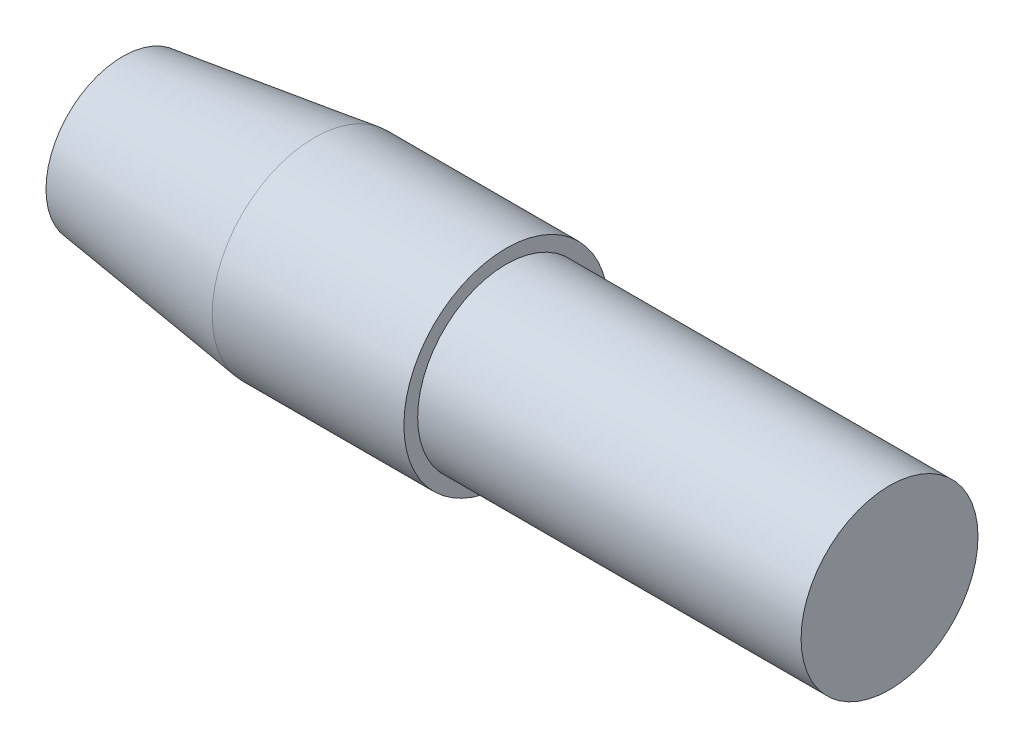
ISO-10303-21;
HEADER;
FILE_DESCRIPTION(('STEP AP214'),'2;1');
FILE_NAME('part.step','',(''),(''),'','','');
FILE_SCHEMA(('AUTOMOTIVE_DESIGN { 1 0 10303 214 1 1 1 1 }'));
ENDSEC;
DATA;
#1=APPLICATION_CONTEXT('core data for automotive mechanical design processes');
#2=APPLICATION_PROTOCOL_DEFINITION('international standard','automotive_design',2000,#1);
#3=PRODUCT_CONTEXT('',#1,'mechanical');
#4=PRODUCT('Part','Part','',(#3));
#5=PRODUCT_RELATED_PRODUCT_CATEGORY('part','',(#4));
#6=PRODUCT_DEFINITION_FORMATION('','',#4);
#7=PRODUCT_DEFINITION_CONTEXT('part definition',#1,'design');
#8=PRODUCT_DEFINITION('design','',#6,#7);
#9=PRODUCT_DEFINITION_SHAPE('','',#8);
#10=(LENGTH_UNIT() NAMED_UNIT(*) SI_UNIT(.MILLI.,.METRE.));
#11=(NAMED_UNIT(*) PLANE_ANGLE_UNIT() SI_UNIT($,.RADIAN.));
#12=(NAMED_UNIT(*) SI_UNIT($,.STERADIAN.) SOLID_ANGLE_UNIT());
#13=UNCERTAINTY_MEASURE_WITH_UNIT(LENGTH_MEASURE(1.E-05),#10,'distance_accuracy_value','');
#14=(GEOMETRIC_REPRESENTATION_CONTEXT(3) GLOBAL_UNCERTAINTY_ASSIGNED_CONTEXT((#13)) GLOBAL_UNIT_ASSIGNED_CONTEXT((#10,
#11,#12)) REPRESENTATION_CONTEXT('',''));
#15=CARTESIAN_POINT('',(0.,0.,0.));
#16=DIRECTION('',(0.,0.,1.));
#17=DIRECTION('',(1.,0.,0.));
#18=AXIS2_PLACEMENT_3D('',#15,#16,#17);
#19=CARTESIAN_POINT('',(0.,3.,0.));
#20=DIRECTION('',(1.,0.,0.));
#21=DIRECTION('',(0.,0.,-1.));
#22=AXIS2_PLACEMENT_3D('',#19,#20,#21);
#23=PLANE('',#22);
#24=CARTESIAN_POINT('',(0.,0.,0.));
#25=DIRECTION('',(-1.,0.,0.));
#26=DIRECTION('',(0.,0.,1.));
#27=AXIS2_PLACEMENT_3D('',#24,#25,#26);
#28=CIRCLE('',#27,3.);
#29=CARTESIAN_POINT('',(0.,0.,2.99999999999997));
#30=VERTEX_POINT('',#29);
#31=EDGE_CURVE('E51',#30,#30,#28,.T.);
#32=ORIENTED_EDGE('',*,*,#31,.T.);
#33=EDGE_LOOP('',(#32));
#34=FACE_BOUND('',#33,.T.);
#35=ADVANCED_FACE('F32',(#34),#23,.F.);
#36=CARTESIAN_POINT('',(30.,3.46046362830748,0.));
#37=DIRECTION('',(-1.,0.,0.));
#38=DIRECTION('',(0.,0.,1.));
#39=AXIS2_PLACEMENT_3D('',#36,#37,#38);
#40=PLANE('',#39);
#41=CARTESIAN_POINT('',(30.,0.,0.));
#42=DIRECTION('',(-1.,0.,0.));
#43=DIRECTION('',(0.,0.,1.));
#44=AXIS2_PLACEMENT_3D('',#41,#42,#43);
#45=CIRCLE('',#44,3.46046362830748);
#46=CARTESIAN_POINT('',(30.,0.,3.46046362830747));
#47=VERTEX_POINT('',#46);
#48=EDGE_CURVE('E10',#47,#47,#45,.T.);
#49=ORIENTED_EDGE('',*,*,#48,.F.);
#50=EDGE_LOOP('',(#49));
#51=FACE_BOUND('',#50,.T.);
#52=ADVANCED_FACE('F75',(#51),#40,.F.);
#53=CARTESIAN_POINT('',(0.,0.,0.));
#54=DIRECTION('',(-1.,0.,0.));
#55=DIRECTION('',(0.,0.,1.));
#56=AXIS2_PLACEMENT_3D('',#53,#54,#55);
#57=CYLINDRICAL_SURFACE('',#56,3.46046362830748);
#58=CARTESIAN_POINT('',(15.,0.,0.));
#59=DIRECTION('',(-1.,0.,0.));
#60=DIRECTION('',(0.,0.,1.));
#61=AXIS2_PLACEMENT_3D('',#58,#59,#60);
#62=CIRCLE('',#61,3.46046362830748);
#63=CARTESIAN_POINT('',(15.,0.,3.46046362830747));
#64=VERTEX_POINT('',#63);
#65=EDGE_CURVE('E38',#64,#64,#62,.T.);
#66=ORIENTED_EDGE('',*,*,#65,.F.);
#67=EDGE_LOOP('',(#66));
#68=FACE_BOUND('',#67,.T.);
#69=ORIENTED_EDGE('',*,*,#48,.T.);
#70=EDGE_LOOP('',(#69));
#71=FACE_BOUND('',#70,.T.);
#72=ADVANCED_FACE('F70',(#68,#71),#57,.T.);
#73=CARTESIAN_POINT('',(15.,3.46046362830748,0.));
#74=DIRECTION('',(-1.,0.,0.));
#75=DIRECTION('',(0.,0.,1.));
#76=AXIS2_PLACEMENT_3D('',#73,#74,#75);
#77=PLANE('',#76);
#78=CARTESIAN_POINT('',(15.,0.,0.));
#79=DIRECTION('',(-1.,0.,0.));
#80=DIRECTION('',(0.,0.,1.));
#81=AXIS2_PLACEMENT_3D('',#78,#79,#80);
#82=CIRCLE('',#81,4.);
#83=CARTESIAN_POINT('',(15.,0.,3.99999999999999));
#84=VERTEX_POINT('',#83);
#85=EDGE_CURVE('E42',#84,#84,#82,.T.);
#86=ORIENTED_EDGE('',*,*,#85,.F.);
#87=EDGE_LOOP('',(#86));
#88=FACE_BOUND('',#87,.T.);
#89=ORIENTED_EDGE('',*,*,#65,.T.);
#90=EDGE_LOOP('',(#89));
#91=FACE_BOUND('',#90,.T.);
#92=ADVANCED_FACE('F65',(#88,#91),#77,.F.);
#93=CARTESIAN_POINT('',(0.,0.,0.));
#94=DIRECTION('',(-1.,0.,0.));
#95=DIRECTION('',(0.,0.,1.));
#96=AXIS2_PLACEMENT_3D('',#93,#94,#95);
#97=CYLINDRICAL_SURFACE('',#96,4.);
#98=CARTESIAN_POINT('',(7.50000000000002,0.,0.));
#99=DIRECTION('',(-1.,0.,0.));
#100=DIRECTION('',(0.,0.,1.));
#101=AXIS2_PLACEMENT_3D('',#98,#99,#100);
#102=CIRCLE('',#101,4.);
#103=CARTESIAN_POINT('',(7.50000000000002,0.,3.99999999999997));
#104=VERTEX_POINT('',#103);
#105=EDGE_CURVE('E46',#104,#104,#102,.T.);
#106=ORIENTED_EDGE('',*,*,#105,.F.);
#107=EDGE_LOOP('',(#106));
#108=FACE_BOUND('',#107,.T.);
#109=ORIENTED_EDGE('',*,*,#85,.T.);
#110=EDGE_LOOP('',(#109));
#111=FACE_BOUND('',#110,.T.);
#112=ADVANCED_FACE('F59',(#108,#111),#97,.T.);
#113=CARTESIAN_POINT('',(7.50000000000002,0.,0.));
#114=DIRECTION('',(1.,0.,0.));
#115=DIRECTION('',(0.,0.,-1.));
#116=AXIS2_PLACEMENT_3D('',#113,#114,#115);
#117=CONICAL_SURFACE('',#116,4.,0.132551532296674);
#118=ORIENTED_EDGE('',*,*,#31,.F.);
#119=EDGE_LOOP('',(#118));
#120=FACE_BOUND('',#119,.T.);
#121=ORIENTED_EDGE('',*,*,#105,.T.);
#122=EDGE_LOOP('',(#121));
#123=FACE_BOUND('',#122,.T.);
#124=ADVANCED_FACE('F56',(#120,#123),#117,.T.);
#125=CLOSED_SHELL('',(#35,#52,#72,#92,#112,#124));
#126=MANIFOLD_SOLID_BREP('B2',#125);
#127=ADVANCED_BREP_SHAPE_REPRESENTATION('',(#18,#126),#14);
#128=SHAPE_DEFINITION_REPRESENTATION(#9,#127);
ENDSEC;
END-ISO-10303-21;
